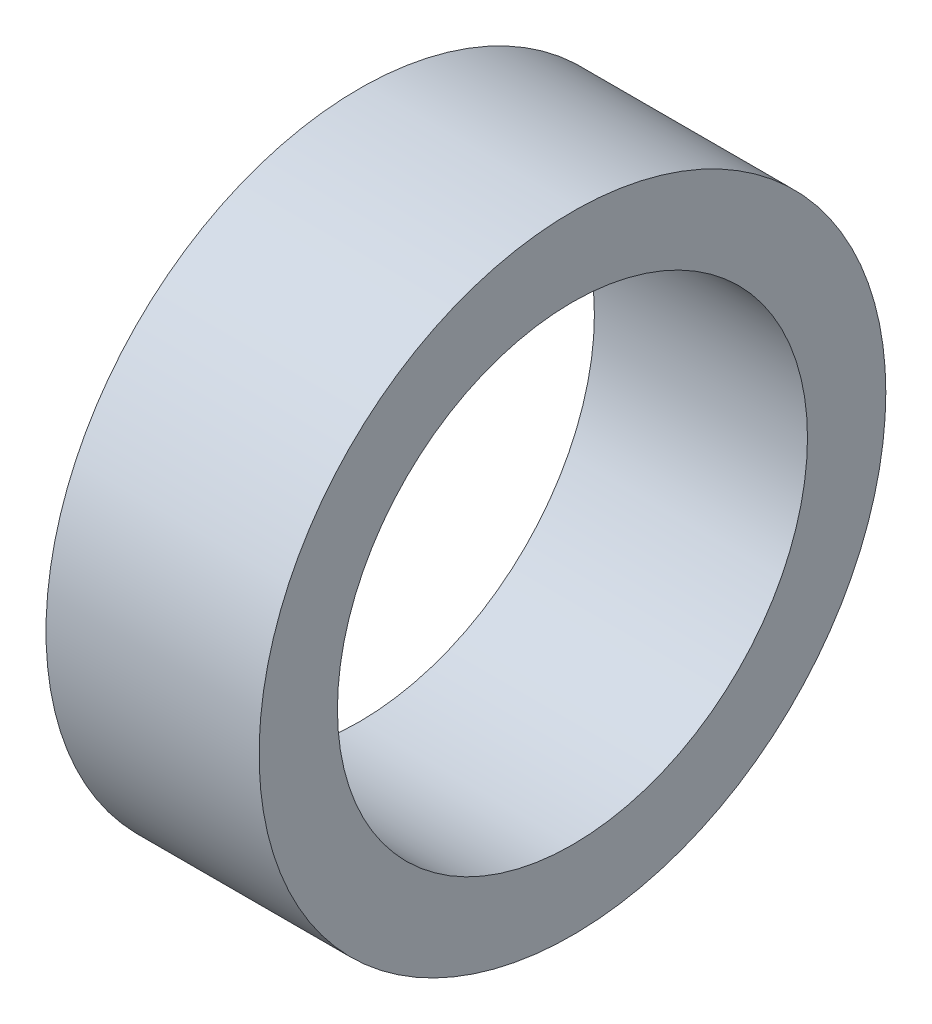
ISO-10303-21;
HEADER;
FILE_DESCRIPTION(('STEP AP214'),'2;1');
FILE_NAME('part.step','',(''),(''),'','','');
FILE_SCHEMA(('AUTOMOTIVE_DESIGN { 1 0 10303 214 1 1 1 1 }'));
ENDSEC;
DATA;
#1=APPLICATION_CONTEXT('core data for automotive mechanical design processes');
#2=APPLICATION_PROTOCOL_DEFINITION('international standard','automotive_design',2000,#1);
#3=PRODUCT_CONTEXT('',#1,'mechanical');
#4=PRODUCT('Part','Part','',(#3));
#5=PRODUCT_RELATED_PRODUCT_CATEGORY('part','',(#4));
#6=PRODUCT_DEFINITION_FORMATION('','',#4);
#7=PRODUCT_DEFINITION_CONTEXT('part definition',#1,'design');
#8=PRODUCT_DEFINITION('design','',#6,#7);
#9=PRODUCT_DEFINITION_SHAPE('','',#8);
#10=(LENGTH_UNIT() NAMED_UNIT(*) SI_UNIT(.MILLI.,.METRE.));
#11=(NAMED_UNIT(*) PLANE_ANGLE_UNIT() SI_UNIT($,.RADIAN.));
#12=(NAMED_UNIT(*) SI_UNIT($,.STERADIAN.) SOLID_ANGLE_UNIT());
#13=UNCERTAINTY_MEASURE_WITH_UNIT(LENGTH_MEASURE(1.E-05),#10,'distance_accuracy_value','');
#14=(GEOMETRIC_REPRESENTATION_CONTEXT(3) GLOBAL_UNCERTAINTY_ASSIGNED_CONTEXT((#13)) GLOBAL_UNIT_ASSIGNED_CONTEXT((#10,
#11,#12)) REPRESENTATION_CONTEXT('',''));
#15=CARTESIAN_POINT('',(0.,0.,0.));
#16=DIRECTION('',(0.,0.,1.));
#17=DIRECTION('',(1.,0.,0.));
#18=AXIS2_PLACEMENT_3D('',#15,#16,#17);
#19=CARTESIAN_POINT('',(6.8,0.,0.));
#20=DIRECTION('',(1.,0.,0.));
#21=DIRECTION('',(0.,0.,-1.));
#22=AXIS2_PLACEMENT_3D('',#19,#20,#21);
#23=PLANE('',#22);
#24=CARTESIAN_POINT('',(6.8,0.,0.));
#25=DIRECTION('',(1.,0.,0.));
#26=DIRECTION('',(0.,0.,-1.));
#27=AXIS2_PLACEMENT_3D('',#24,#25,#26);
#28=CIRCLE('',#27,10.);
#29=CARTESIAN_POINT('',(6.8,0.,-10.));
#30=VERTEX_POINT('',#29);
#31=EDGE_CURVE('E10',#30,#30,#28,.T.);
#32=ORIENTED_EDGE('',*,*,#31,.T.);
#33=EDGE_LOOP('',(#32));
#34=FACE_BOUND('',#33,.T.);
#35=CARTESIAN_POINT('',(6.8,0.,0.));
#36=DIRECTION('',(1.,0.,0.));
#37=DIRECTION('',(0.,0.,-1.));
#38=AXIS2_PLACEMENT_3D('',#35,#36,#37);
#39=CIRCLE('',#38,7.5);
#40=CARTESIAN_POINT('',(6.8,0.,-7.5));
#41=VERTEX_POINT('',#40);
#42=EDGE_CURVE('E49',#41,#41,#39,.T.);
#43=ORIENTED_EDGE('',*,*,#42,.F.);
#44=EDGE_LOOP('',(#43));
#45=FACE_BOUND('',#44,.T.);
#46=ADVANCED_FACE('F38',(#34,#45),#23,.T.);
#47=CARTESIAN_POINT('',(0.,0.,0.));
#48=DIRECTION('',(1.,0.,0.));
#49=DIRECTION('',(0.,0.,-1.));
#50=AXIS2_PLACEMENT_3D('',#47,#48,#49);
#51=PLANE('',#50);
#52=CARTESIAN_POINT('',(0.,0.,0.));
#53=DIRECTION('',(1.,0.,0.));
#54=DIRECTION('',(0.,0.,-1.));
#55=AXIS2_PLACEMENT_3D('',#52,#53,#54);
#56=CIRCLE('',#55,10.);
#57=CARTESIAN_POINT('',(0.,0.,-10.));
#58=VERTEX_POINT('',#57);
#59=EDGE_CURVE('E42',#58,#58,#56,.T.);
#60=ORIENTED_EDGE('',*,*,#59,.F.);
#61=EDGE_LOOP('',(#60));
#62=FACE_BOUND('',#61,.T.);
#63=CARTESIAN_POINT('',(0.,0.,0.));
#64=DIRECTION('',(1.,0.,0.));
#65=DIRECTION('',(0.,0.,-1.));
#66=AXIS2_PLACEMENT_3D('',#63,#64,#65);
#67=CIRCLE('',#66,7.5);
#68=CARTESIAN_POINT('',(0.,0.,-7.5));
#69=VERTEX_POINT('',#68);
#70=EDGE_CURVE('E51',#69,#69,#67,.T.);
#71=ORIENTED_EDGE('',*,*,#70,.T.);
#72=EDGE_LOOP('',(#71));
#73=FACE_BOUND('',#72,.T.);
#74=ADVANCED_FACE('F61',(#62,#73),#51,.F.);
#75=CARTESIAN_POINT('',(6.8,0.,0.));
#76=DIRECTION('',(-1.,0.,0.));
#77=DIRECTION('',(0.,0.,1.));
#78=AXIS2_PLACEMENT_3D('',#75,#76,#77);
#79=CYLINDRICAL_SURFACE('',#78,10.);
#80=ORIENTED_EDGE('',*,*,#31,.F.);
#81=EDGE_LOOP('',(#80));
#82=FACE_BOUND('',#81,.T.);
#83=ORIENTED_EDGE('',*,*,#59,.T.);
#84=EDGE_LOOP('',(#83));
#85=FACE_BOUND('',#84,.T.);
#86=ADVANCED_FACE('F40',(#82,#85),#79,.T.);
#87=CARTESIAN_POINT('',(6.8,0.,0.));
#88=DIRECTION('',(-1.,0.,0.));
#89=DIRECTION('',(0.,0.,1.));
#90=AXIS2_PLACEMENT_3D('',#87,#88,#89);
#91=CYLINDRICAL_SURFACE('',#90,7.5);
#92=ORIENTED_EDGE('',*,*,#42,.T.);
#93=EDGE_LOOP('',(#92));
#94=FACE_BOUND('',#93,.T.);
#95=ORIENTED_EDGE('',*,*,#70,.F.);
#96=EDGE_LOOP('',(#95));
#97=FACE_BOUND('',#96,.T.);
#98=ADVANCED_FACE('F57',(#94,#97),#91,.F.);
#99=CLOSED_SHELL('',(#46,#74,#86,#98));
#100=MANIFOLD_SOLID_BREP('B2',#99);
#101=ADVANCED_BREP_SHAPE_REPRESENTATION('',(#18,#100),#14);
#102=SHAPE_DEFINITION_REPRESENTATION(#9,#101);
ENDSEC;
END-ISO-10303-21;
